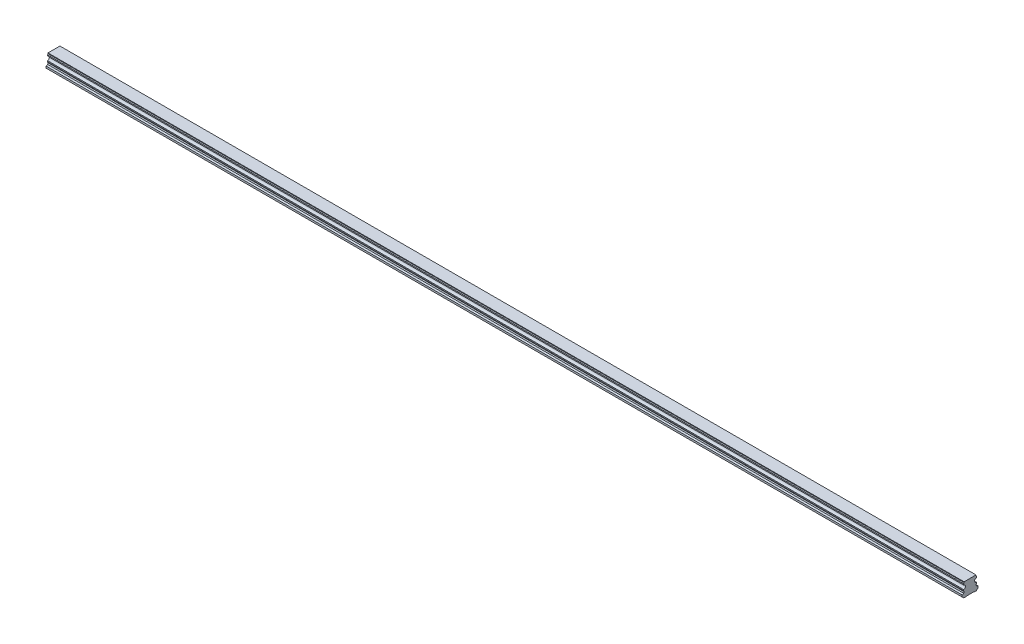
from build123d import *

# Parameters (mm, degrees)
BOSS_EXTRUDE1_DEPTH        = 1440
SKETCH3_R                  = 3
SKETCH3_R_2                = 2.5
CUT_EXTRUDE3_DEPTH         = 12
SKETCH3_2_R                = 2.5
CUT_EXTRUDE4_DEPTH         = 15
CHAMFER1_SIZE              = 0.5
LPATTERN4_COUNT            = 24
LPATTERN4_PITCH            = 60
CHAMFER1_OF_LPATTERN4_SIZE = 0.5


with BuildPart() as part:
    # Sketch1 → Boss-Extrude1 (new body)
    with BuildSketch(Plane(origin=(0, 0, 0), x_dir=(0, 0, -1), z_dir=(1, 0, 0))):
        with BuildLine():
            Line((9.375, 21.8), (-9.375, 21.8))
            Line((-9.375, 21.8), (-9.375, 20.756))
            Line((-9.375, 20.756), (-10, 19.415683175))
            Line((-10, 19.415683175), (-10, 17.685449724))
            ThreePointArc((-10, 17.685449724), (-7.2, 14.6), (-10, 11.514550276))
            Line((-10, 11.514550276), (-10, 9.784316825))
            Line((-10, 9.784316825), (-9.375, 8.444))
            Line((-9.375, 8.444), (-9.922688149, 6.4))
            Line((-9.922688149, 6.4), (-12.5, 5.489338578))
            Line((-12.5, 5.489338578), (-12.5, 2.65))
            Line((-12.5, 2.65), (-9.85, 0))
            Line((-9.85, 0), (-5.5, 0))
            Line((-5.5, 0), (-5, 0.5))
            Line((-5, 0.5), (5, 0.5))
            Line((5, 0.5), (5.5, 0))
            Line((5.5, 0), (9.85, 0))
            Line((9.85, 0), (12.5, 2.65))
            Line((12.5, 2.65), (12.5, 5.489338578))
            Line((12.5, 5.489338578), (9.922688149, 6.4))
            Line((9.922688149, 6.4), (9.375, 8.444))
            Line((9.375, 8.444), (10, 9.784316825))
            Line((10, 9.784316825), (10, 11.514550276))
            ThreePointArc((10, 11.514550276), (7.2, 14.6), (10, 17.685449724))
            Line((10, 17.685449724), (10, 19.415683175))
            Line((10, 19.415683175), (9.375, 20.756))
            Line((9.375, 20.756), (9.375, 21.8))
        make_face()
    extrude(amount=BOSS_EXTRUDE1_DEPTH)

    # Sketch3 → Cut-Extrude3 (cut)
    with BuildSketch(Plane.XZ):
        with Locations(Location((30, 0, 0), (0, 0, 270))):
            Circle(SKETCH3_R)
        with Locations(Location((30, 0, 0), (0, 0, 270))):
            Circle(SKETCH3_R_2, mode=Mode.SUBTRACT)
    cut_extrude3 = extrude(amount=-CUT_EXTRUDE3_DEPTH, mode=Mode.SUBTRACT)

    # Sketch3_2 → Cut-Extrude4 (cut)
    with BuildSketch(Plane.XZ):
        with Locations(Location((30, 0, 0), (0, 0, 270))):
            Circle(SKETCH3_2_R)
    cut_extrude4 = extrude(amount=-CUT_EXTRUDE4_DEPTH, mode=Mode.SUBTRACT)

    # Cut-Extrude5 cone 1 section (on through the dimple's axis) → Cut-Extrude5 (revolve, cut)
    with BuildSketch(Plane(origin=(30, 15, 0), x_dir=(0, 0, -1), z_dir=(1, 0, 0))):
        Polygon((0, 0), (2.5, 0), (0, 1.443375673), align=None)
    cut_extrude5 = revolve(axis=Axis((30, 15, 0), (0, 1, 0)), mode=Mode.SUBTRACT)

    # Chamfer1
    chamfer1_edges = [part.edges().sort_by_distance(p)[0] for p in [
        (30, 0.5, 3),
    ]]
    chamfer(chamfer1_edges, length=CHAMFER1_SIZE)

    # LPattern4: Cut-Extrude3, Cut-Extrude4, Cut-Extrude5 ×24
    with Locations(*[(i * LPATTERN4_PITCH, 0, 0) for i in range(1, LPATTERN4_COUNT)]):
        add(cut_extrude3, mode=Mode.SUBTRACT)
        add(cut_extrude4, mode=Mode.SUBTRACT)
        add(cut_extrude5, mode=Mode.SUBTRACT)

    # Chamfer1 of LPattern4
    chamfer1_of_lpattern4_edges = [part.edges().sort_by_distance(p)[0] for p in [
        (90, 0.5, 3),
        (150, 0.5, 3),
        (210, 0.5, 3),
        (270, 0.5, 3),
        (330, 0.5, 3),
        (390, 0.5, 3),
        (450, 0.5, 3),
        (510, 0.5, 3),
        (570, 0.5, 3),
        (630, 0.5, 3),
        (690, 0.5, 3),
        (750, 0.5, 3),
        (810, 0.5, 3),
        (870, 0.5, 3),
        (930, 0.5, 3),
        (990, 0.5, 3),
        (1050, 0.5, 3),
        (1110, 0.5, 3),
        (1170, 0.5, 3),
        (1230, 0.5, 3),
        (1290, 0.5, 3),
        (1350, 0.5, 3),
        (1410, 0.5, 3),
    ]]
    chamfer(chamfer1_of_lpattern4_edges, length=CHAMFER1_OF_LPATTERN4_SIZE)


solid = part.part
